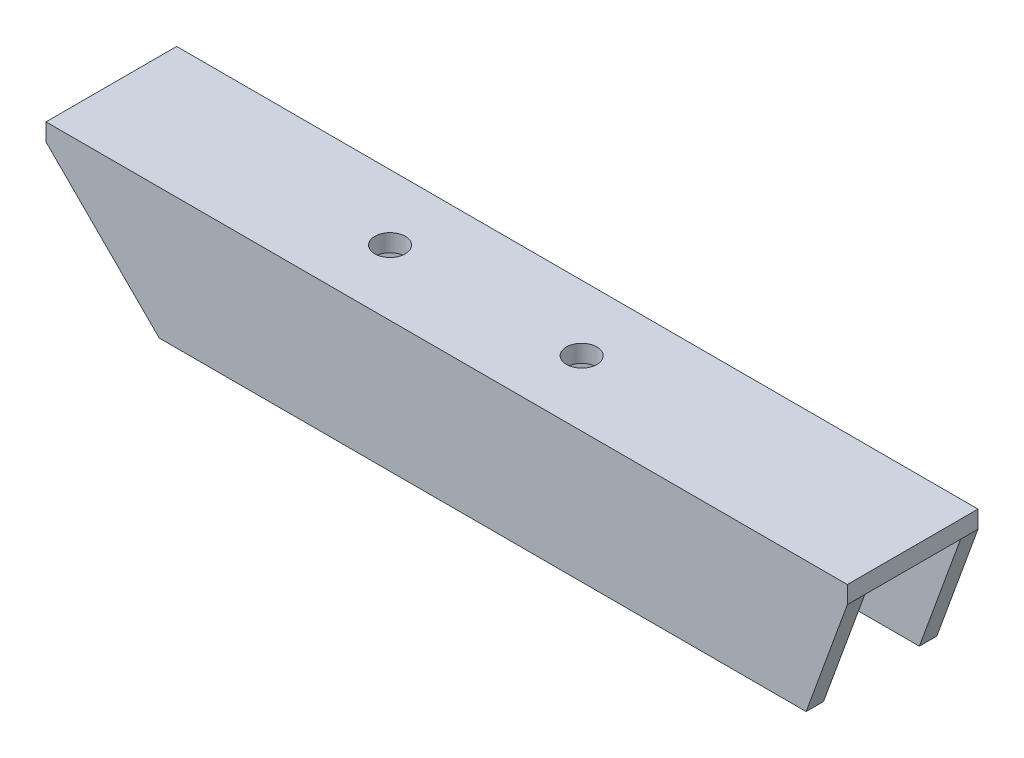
from build123d import *

# Parameters (mm, degrees)
BOSS_EXTRUDE1_DEPTH = 92
CUT_EXTRUDE1_DEPTH  = 92
SKETCH3_R           = 1.75
CUT_EXTRUDE2_DEPTH  = 92


with BuildPart() as part:
    # Sketch1 → Boss-Extrude1 (new body)
    with BuildSketch(Plane(origin=(0, 0, 0), x_dir=(0, 0, -1), z_dir=(1, 0, 0))):
        Polygon((0, 0), (0, 15), (15, 15), (15, 0), (13, 0), (13, 13), (2, 13), (2, 0), align=None)
    extrude(amount=BOSS_EXTRUDE1_DEPTH)

    # Sketch2 → Cut-Extrude1 (cut)
    with BuildSketch(Plane.XY):
        Polygon((0, 13), (13, 0), (0, 0), align=None)
        Polygon((92, 13), (92, 0), (87.268386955, 0), align=None)
    extrude(amount=-CUT_EXTRUDE1_DEPTH, mode=Mode.SUBTRACT)

    # Sketch3 → Cut-Extrude2 (cut)
    with BuildSketch(Plane(origin=(0, 15, 0), x_dir=(1, 0, 0), z_dir=(0, 1, 0))):
        with Locations(Location((32, 7.5, 0), (0, 0, 270))):
            Circle(SKETCH3_R)
        with Locations(Location((54, 7.5, 0), (0, 0, 270))):
            Circle(SKETCH3_R)
    extrude(amount=-CUT_EXTRUDE2_DEPTH, mode=Mode.SUBTRACT)


solid = part.part
